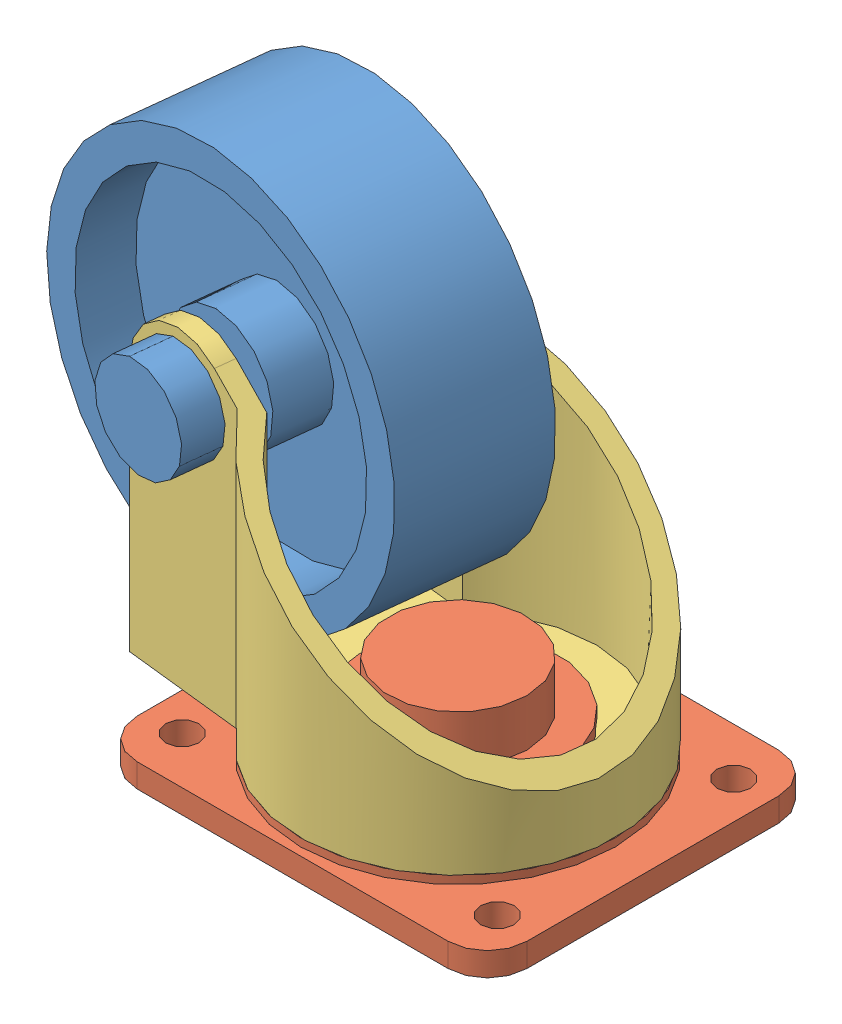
SolidWorks assembly 2583.sldasm, configuration Défaut (file format 8000). Lengths in mm.
Overall size (152.48 126.46 92.33).
3 component instances, 3 part files, 5 mates.
Components (placement in the parent):
- 2583 ROUE-2: 2583 ROUE.sldprt [Défaut] at (-44.7284 72 -4.9369) x (0.109709 0 -0.993964) z (0.989594 0.093666 0.109227) size (75 100 100)
- 2583-1: 2583.sldprt [Défaut] at origin size (99 28 84)
- 2583 FOURCHE-1: 2583 FOURCHE.sldprt [Défaut] at (0 8 0) x (0.109709 0 -0.993964) z (0.993964 0 0.109709) size (80 79 110)
Mates (geometry in assembly coordinates):
- Coaxiale1: concentric aligned: cylinder of assembly through (-48.8425 72 32.3367) axis (-0.109709 0 0.993964) radius 12.5
- Coïncidente1: coincident anti-aligned: circle of 2583 ROUE-2; plane of 2583 FOURCHE-1
- Coïncidente2: coincident anti-aligned: plane of 2583-1; plane of 2583 FOURCHE-1
- Coïncidente3: coincident aligned: cylinder of assembly through (0 6 0) axis (0 -1 0) radius 25
- Angle1: planar angle aligned: plane of 2583 ROUE-2; plane of 2583-1
